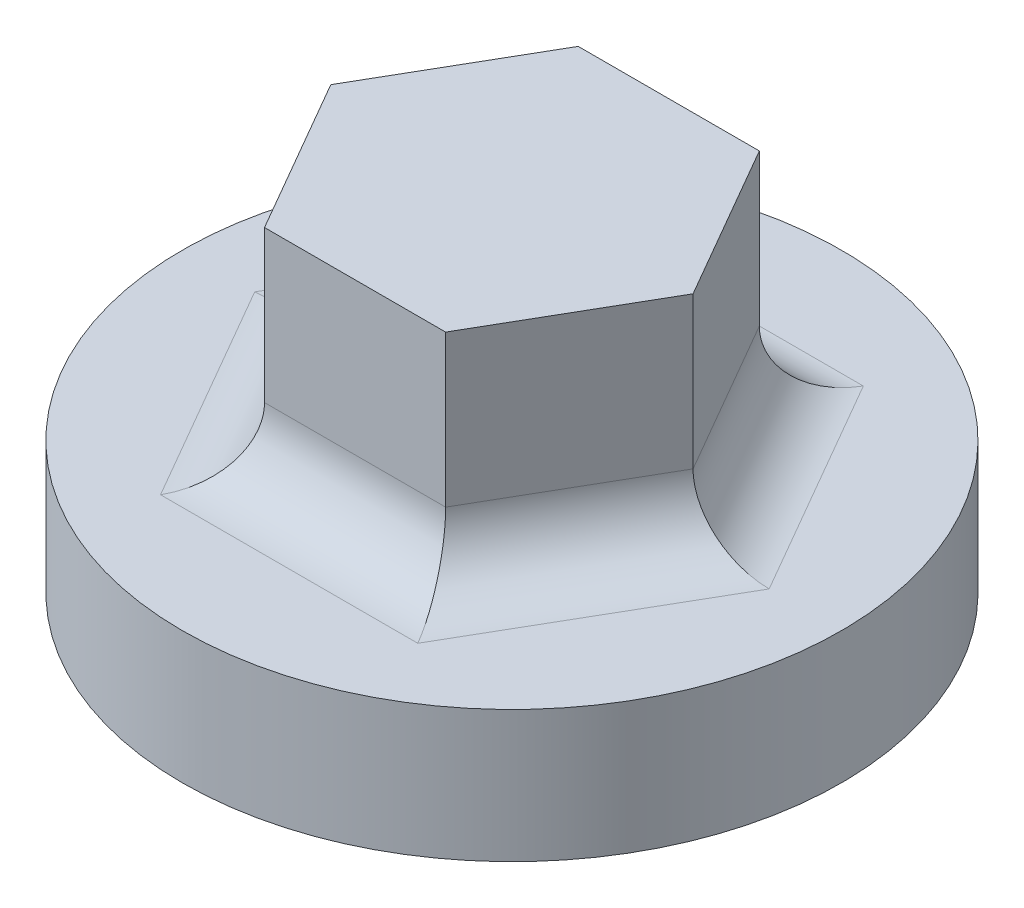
ISO-10303-21;
HEADER;
FILE_DESCRIPTION(('STEP AP214'),'2;1');
FILE_NAME('part.step','',(''),(''),'','','');
FILE_SCHEMA(('AUTOMOTIVE_DESIGN { 1 0 10303 214 1 1 1 1 }'));
ENDSEC;
DATA;
#1=APPLICATION_CONTEXT('core data for automotive mechanical design processes');
#2=APPLICATION_PROTOCOL_DEFINITION('international standard','automotive_design',2000,#1);
#3=PRODUCT_CONTEXT('',#1,'mechanical');
#4=PRODUCT('Part','Part','',(#3));
#5=PRODUCT_RELATED_PRODUCT_CATEGORY('part','',(#4));
#6=PRODUCT_DEFINITION_FORMATION('','',#4);
#7=PRODUCT_DEFINITION_CONTEXT('part definition',#1,'design');
#8=PRODUCT_DEFINITION('design','',#6,#7);
#9=PRODUCT_DEFINITION_SHAPE('','',#8);
#10=(LENGTH_UNIT() NAMED_UNIT(*) SI_UNIT(.MILLI.,.METRE.));
#11=(NAMED_UNIT(*) PLANE_ANGLE_UNIT() SI_UNIT($,.RADIAN.));
#12=(NAMED_UNIT(*) SI_UNIT($,.STERADIAN.) SOLID_ANGLE_UNIT());
#13=UNCERTAINTY_MEASURE_WITH_UNIT(LENGTH_MEASURE(1.E-05),#10,'distance_accuracy_value','');
#14=(GEOMETRIC_REPRESENTATION_CONTEXT(3) GLOBAL_UNCERTAINTY_ASSIGNED_CONTEXT((#13)) GLOBAL_UNIT_ASSIGNED_CONTEXT((#10,
#11,#12)) REPRESENTATION_CONTEXT('',''));
#15=CARTESIAN_POINT('',(0.,0.,0.));
#16=DIRECTION('',(0.,0.,1.));
#17=DIRECTION('',(1.,0.,0.));
#18=AXIS2_PLACEMENT_3D('',#15,#16,#17);
#19=CARTESIAN_POINT('',(0.,20.,0.));
#20=DIRECTION('',(0.,1.,0.));
#21=DIRECTION('',(0.,0.,1.));
#22=AXIS2_PLACEMENT_3D('',#19,#20,#21);
#23=PLANE('',#22);
#24=DIRECTION('',(1.,0.,0.));
#25=VECTOR('',#24,1.);
#26=CARTESIAN_POINT('',(0.,20.,33.7979229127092));
#27=LINE('',#26,#25);
#28=CARTESIAN_POINT('',(19.5132398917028,20.,33.7979229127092));
#29=VERTEX_POINT('',#28);
#30=CARTESIAN_POINT('',(-19.5132398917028,20.,33.7979229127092));
#31=VERTEX_POINT('',#30);
#32=EDGE_CURVE('E138',#29,#31,#27,.F.);
#33=ORIENTED_EDGE('',*,*,#32,.T.);
#34=DIRECTION('',(0.5,0.,0.866025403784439));
#35=VECTOR('',#34,1.);
#36=CARTESIAN_POINT('',(-29.2698598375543,20.,16.8989614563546));
#37=LINE('',#36,#35);
#38=CARTESIAN_POINT('',(-39.0264797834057,20.,0.));
#39=VERTEX_POINT('',#38);
#40=EDGE_CURVE('E146',#31,#39,#37,.F.);
#41=ORIENTED_EDGE('',*,*,#40,.T.);
#42=DIRECTION('',(-0.5,0.,0.866025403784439));
#43=VECTOR('',#42,1.);
#44=CARTESIAN_POINT('',(-29.2698598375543,20.,-16.8989614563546));
#45=LINE('',#44,#43);
#46=CARTESIAN_POINT('',(-19.5132398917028,20.,-33.7979229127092));
#47=VERTEX_POINT('',#46);
#48=EDGE_CURVE('E144',#39,#47,#45,.F.);
#49=ORIENTED_EDGE('',*,*,#48,.T.);
#50=DIRECTION('',(-1.,0.,0.));
#51=VECTOR('',#50,1.);
#52=CARTESIAN_POINT('',(0.,20.,-33.7979229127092));
#53=LINE('',#52,#51);
#54=CARTESIAN_POINT('',(19.5132398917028,20.,-33.7979229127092));
#55=VERTEX_POINT('',#54);
#56=EDGE_CURVE('E142',#47,#55,#53,.F.);
#57=ORIENTED_EDGE('',*,*,#56,.T.);
#58=DIRECTION('',(-0.5,0.,-0.866025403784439));
#59=VECTOR('',#58,1.);
#60=CARTESIAN_POINT('',(29.2698598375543,20.,-16.8989614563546));
#61=LINE('',#60,#59);
#62=CARTESIAN_POINT('',(39.0264797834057,20.,0.));
#63=VERTEX_POINT('',#62);
#64=EDGE_CURVE('E140',#55,#63,#61,.F.);
#65=ORIENTED_EDGE('',*,*,#64,.T.);
#66=DIRECTION('',(0.5,0.,-0.866025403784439));
#67=VECTOR('',#66,1.);
#68=CARTESIAN_POINT('',(29.2698598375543,20.,16.8989614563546));
#69=LINE('',#68,#67);
#70=EDGE_CURVE('E136',#63,#29,#69,.F.);
#71=ORIENTED_EDGE('',*,*,#70,.T.);
#72=EDGE_LOOP('',(#33,#41,#49,#57,#65,#71));
#73=FACE_BOUND('',#72,.T.);
#74=CARTESIAN_POINT('',(0.,20.,0.));
#75=DIRECTION('',(0.,1.,0.));
#76=DIRECTION('',(0.,0.,1.));
#77=AXIS2_PLACEMENT_3D('',#74,#75,#76);
#78=CIRCLE('',#77,50.);
#79=CARTESIAN_POINT('',(0.,20.,50.));
#80=VERTEX_POINT('',#79);
#81=EDGE_CURVE('E126',#80,#80,#78,.T.);
#82=ORIENTED_EDGE('',*,*,#81,.T.);
#83=EDGE_LOOP('',(#82));
#84=FACE_BOUND('',#83,.T.);
#85=ADVANCED_FACE('F27',(#73,#84),#23,.T.);
#86=CARTESIAN_POINT('',(0.,20.,0.));
#87=DIRECTION('',(0.,-1.,0.));
#88=DIRECTION('',(0.,0.,-1.));
#89=AXIS2_PLACEMENT_3D('',#86,#87,#88);
#90=CYLINDRICAL_SURFACE('',#89,50.);
#91=ORIENTED_EDGE('',*,*,#81,.F.);
#92=EDGE_LOOP('',(#91));
#93=FACE_BOUND('',#92,.T.);
#94=CARTESIAN_POINT('',(0.,0.,0.));
#95=DIRECTION('',(0.,1.,0.));
#96=DIRECTION('',(0.,0.,1.));
#97=AXIS2_PLACEMENT_3D('',#94,#95,#96);
#98=CIRCLE('',#97,50.);
#99=CARTESIAN_POINT('',(0.,0.,50.));
#100=VERTEX_POINT('',#99);
#101=EDGE_CURVE('E123',#100,#100,#98,.T.);
#102=ORIENTED_EDGE('',*,*,#101,.T.);
#103=EDGE_LOOP('',(#102));
#104=FACE_BOUND('',#103,.T.);
#105=ADVANCED_FACE('F29',(#93,#104),#90,.T.);
#106=CARTESIAN_POINT('',(0.,0.,0.));
#107=DIRECTION('',(0.,1.,0.));
#108=DIRECTION('',(0.,0.,1.));
#109=AXIS2_PLACEMENT_3D('',#106,#107,#108);
#110=PLANE('',#109);
#111=ORIENTED_EDGE('',*,*,#101,.F.);
#112=EDGE_LOOP('',(#111));
#113=FACE_BOUND('',#112,.T.);
#114=ADVANCED_FACE('F223',(#113),#110,.F.);
#115=CARTESIAN_POINT('',(-13.7397371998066,53.,-23.7979229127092));
#116=DIRECTION('',(0.866025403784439,0.,0.5));
#117=DIRECTION('',(0.5,0.,-0.866025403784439));
#118=AXIS2_PLACEMENT_3D('',#115,#116,#117);
#119=PLANE('',#118);
#120=DIRECTION('',(0.,-1.,0.));
#121=VECTOR('',#120,1.);
#122=CARTESIAN_POINT('',(-13.7397371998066,53.,-23.7979229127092));
#123=LINE('',#122,#121);
#124=CARTESIAN_POINT('',(-13.7397371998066,53.,-23.7979229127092));
#125=VERTEX_POINT('',#124);
#126=CARTESIAN_POINT('',(-13.7397371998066,30.,-23.7979229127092));
#127=VERTEX_POINT('',#126);
#128=EDGE_CURVE('E168',#125,#127,#123,.T.);
#129=ORIENTED_EDGE('',*,*,#128,.T.);
#130=DIRECTION('',(-0.5,0.,0.866025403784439));
#131=VECTOR('',#130,1.);
#132=CARTESIAN_POINT('',(-13.7397371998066,30.,-23.7979229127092));
#133=LINE('',#132,#131);
#134=CARTESIAN_POINT('',(-27.4794743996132,30.,0.));
#135=VERTEX_POINT('',#134);
#136=EDGE_CURVE('E122',#127,#135,#133,.T.);
#137=ORIENTED_EDGE('',*,*,#136,.T.);
#138=DIRECTION('',(0.,-1.,0.));
#139=VECTOR('',#138,1.);
#140=CARTESIAN_POINT('',(-27.4794743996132,53.,0.));
#141=LINE('',#140,#139);
#142=CARTESIAN_POINT('',(-27.4794743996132,53.,0.));
#143=VERTEX_POINT('',#142);
#144=EDGE_CURVE('E103',#143,#135,#141,.T.);
#145=ORIENTED_EDGE('',*,*,#144,.F.);
#146=DIRECTION('',(-0.5,0.,0.866025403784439));
#147=VECTOR('',#146,1.);
#148=CARTESIAN_POINT('',(-13.7397371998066,53.,-23.7979229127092));
#149=LINE('',#148,#147);
#150=EDGE_CURVE('E109',#125,#143,#149,.T.);
#151=ORIENTED_EDGE('',*,*,#150,.F.);
#152=EDGE_LOOP('',(#129,#137,#145,#151));
#153=FACE_BOUND('',#152,.T.);
#154=ADVANCED_FACE('F120',(#153),#119,.F.);
#155=CARTESIAN_POINT('',(-27.4794743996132,53.,0.));
#156=DIRECTION('',(0.866025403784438,0.,-0.5));
#157=DIRECTION('',(-0.5,0.,-0.866025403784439));
#158=AXIS2_PLACEMENT_3D('',#155,#156,#157);
#159=PLANE('',#158);
#160=ORIENTED_EDGE('',*,*,#144,.T.);
#161=DIRECTION('',(0.5,0.,0.866025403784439));
#162=VECTOR('',#161,1.);
#163=CARTESIAN_POINT('',(-27.4794743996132,30.,0.));
#164=LINE('',#163,#162);
#165=CARTESIAN_POINT('',(-13.7397371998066,30.,23.7979229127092));
#166=VERTEX_POINT('',#165);
#167=EDGE_CURVE('E134',#135,#166,#164,.T.);
#168=ORIENTED_EDGE('',*,*,#167,.T.);
#169=DIRECTION('',(0.,-1.,0.));
#170=VECTOR('',#169,1.);
#171=CARTESIAN_POINT('',(-13.7397371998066,53.,23.7979229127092));
#172=LINE('',#171,#170);
#173=CARTESIAN_POINT('',(-13.7397371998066,53.,23.7979229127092));
#174=VERTEX_POINT('',#173);
#175=EDGE_CURVE('E105',#174,#166,#172,.T.);
#176=ORIENTED_EDGE('',*,*,#175,.F.);
#177=DIRECTION('',(0.5,0.,0.866025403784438));
#178=VECTOR('',#177,1.);
#179=CARTESIAN_POINT('',(-27.4794743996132,53.,0.));
#180=LINE('',#179,#178);
#181=EDGE_CURVE('E98',#143,#174,#180,.T.);
#182=ORIENTED_EDGE('',*,*,#181,.F.);
#183=EDGE_LOOP('',(#160,#168,#176,#182));
#184=FACE_BOUND('',#183,.T.);
#185=ADVANCED_FACE('F100',(#184),#159,.F.);
#186=CARTESIAN_POINT('',(-13.7397371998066,53.,23.7979229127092));
#187=DIRECTION('',(0.,0.,-1.));
#188=DIRECTION('',(-1.,0.,0.));
#189=AXIS2_PLACEMENT_3D('',#186,#187,#188);
#190=PLANE('',#189);
#191=ORIENTED_EDGE('',*,*,#175,.T.);
#192=DIRECTION('',(1.,0.,0.));
#193=VECTOR('',#192,1.);
#194=CARTESIAN_POINT('',(-13.7397371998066,30.,23.7979229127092));
#195=LINE('',#194,#193);
#196=CARTESIAN_POINT('',(13.7397371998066,30.,23.7979229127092));
#197=VERTEX_POINT('',#196);
#198=EDGE_CURVE('E35',#166,#197,#195,.T.);
#199=ORIENTED_EDGE('',*,*,#198,.T.);
#200=DIRECTION('',(0.,-1.,0.));
#201=VECTOR('',#200,1.);
#202=CARTESIAN_POINT('',(13.7397371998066,53.,23.7979229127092));
#203=LINE('',#202,#201);
#204=CARTESIAN_POINT('',(13.7397371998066,53.,23.7979229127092));
#205=VERTEX_POINT('',#204);
#206=EDGE_CURVE('E128',#205,#197,#203,.T.);
#207=ORIENTED_EDGE('',*,*,#206,.F.);
#208=DIRECTION('',(1.,0.,0.));
#209=VECTOR('',#208,1.);
#210=CARTESIAN_POINT('',(-13.7397371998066,53.,23.7979229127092));
#211=LINE('',#210,#209);
#212=EDGE_CURVE('E108',#174,#205,#211,.T.);
#213=ORIENTED_EDGE('',*,*,#212,.F.);
#214=EDGE_LOOP('',(#191,#199,#207,#213));
#215=FACE_BOUND('',#214,.T.);
#216=ADVANCED_FACE('F194',(#215),#190,.F.);
#217=CARTESIAN_POINT('',(13.7397371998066,53.,23.7979229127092));
#218=DIRECTION('',(-0.866025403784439,0.,-0.5));
#219=DIRECTION('',(-0.5,0.,0.866025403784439));
#220=AXIS2_PLACEMENT_3D('',#217,#218,#219);
#221=PLANE('',#220);
#222=ORIENTED_EDGE('',*,*,#206,.T.);
#223=DIRECTION('',(0.5,0.,-0.866025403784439));
#224=VECTOR('',#223,1.);
#225=CARTESIAN_POINT('',(13.7397371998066,30.,23.7979229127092));
#226=LINE('',#225,#224);
#227=CARTESIAN_POINT('',(27.4794743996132,30.,0.));
#228=VERTEX_POINT('',#227);
#229=EDGE_CURVE('E11',#197,#228,#226,.T.);
#230=ORIENTED_EDGE('',*,*,#229,.T.);
#231=DIRECTION('',(0.,-1.,0.));
#232=VECTOR('',#231,1.);
#233=CARTESIAN_POINT('',(27.4794743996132,53.,0.));
#234=LINE('',#233,#232);
#235=CARTESIAN_POINT('',(27.4794743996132,53.,0.));
#236=VERTEX_POINT('',#235);
#237=EDGE_CURVE('E160',#236,#228,#234,.T.);
#238=ORIENTED_EDGE('',*,*,#237,.F.);
#239=DIRECTION('',(0.5,0.,-0.866025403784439));
#240=VECTOR('',#239,1.);
#241=CARTESIAN_POINT('',(13.7397371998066,53.,23.7979229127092));
#242=LINE('',#241,#240);
#243=EDGE_CURVE('E196',#205,#236,#242,.T.);
#244=ORIENTED_EDGE('',*,*,#243,.F.);
#245=EDGE_LOOP('',(#222,#230,#238,#244));
#246=FACE_BOUND('',#245,.T.);
#247=ADVANCED_FACE('F204',(#246),#221,.F.);
#248=CARTESIAN_POINT('',(27.4794743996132,53.,0.));
#249=DIRECTION('',(-0.866025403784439,0.,0.5));
#250=DIRECTION('',(0.5,0.,0.866025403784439));
#251=AXIS2_PLACEMENT_3D('',#248,#249,#250);
#252=PLANE('',#251);
#253=ORIENTED_EDGE('',*,*,#237,.T.);
#254=DIRECTION('',(-0.5,0.,-0.866025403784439));
#255=VECTOR('',#254,1.);
#256=CARTESIAN_POINT('',(27.4794743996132,30.,0.));
#257=LINE('',#256,#255);
#258=CARTESIAN_POINT('',(13.7397371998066,30.,-23.7979229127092));
#259=VERTEX_POINT('',#258);
#260=EDGE_CURVE('E152',#228,#259,#257,.T.);
#261=ORIENTED_EDGE('',*,*,#260,.T.);
#262=DIRECTION('',(0.,-1.,0.));
#263=VECTOR('',#262,1.);
#264=CARTESIAN_POINT('',(13.7397371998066,53.,-23.7979229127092));
#265=LINE('',#264,#263);
#266=CARTESIAN_POINT('',(13.7397371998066,53.,-23.7979229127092));
#267=VERTEX_POINT('',#266);
#268=EDGE_CURVE('E159',#267,#259,#265,.T.);
#269=ORIENTED_EDGE('',*,*,#268,.F.);
#270=DIRECTION('',(-0.5,0.,-0.866025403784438));
#271=VECTOR('',#270,1.);
#272=CARTESIAN_POINT('',(27.4794743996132,53.,0.));
#273=LINE('',#272,#271);
#274=EDGE_CURVE('E198',#236,#267,#273,.T.);
#275=ORIENTED_EDGE('',*,*,#274,.F.);
#276=EDGE_LOOP('',(#253,#261,#269,#275));
#277=FACE_BOUND('',#276,.T.);
#278=ADVANCED_FACE('F157',(#277),#252,.F.);
#279=CARTESIAN_POINT('',(13.7397371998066,53.,-23.7979229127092));
#280=DIRECTION('',(0.,0.,1.));
#281=DIRECTION('',(1.,0.,0.));
#282=AXIS2_PLACEMENT_3D('',#279,#280,#281);
#283=PLANE('',#282);
#284=ORIENTED_EDGE('',*,*,#268,.T.);
#285=DIRECTION('',(-1.,0.,0.));
#286=VECTOR('',#285,1.);
#287=CARTESIAN_POINT('',(13.7397371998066,30.,-23.7979229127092));
#288=LINE('',#287,#286);
#289=EDGE_CURVE('E150',#259,#127,#288,.T.);
#290=ORIENTED_EDGE('',*,*,#289,.T.);
#291=ORIENTED_EDGE('',*,*,#128,.F.);
#292=DIRECTION('',(-1.,0.,0.));
#293=VECTOR('',#292,1.);
#294=CARTESIAN_POINT('',(13.7397371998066,53.,-23.7979229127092));
#295=LINE('',#294,#293);
#296=EDGE_CURVE('E114',#267,#125,#295,.T.);
#297=ORIENTED_EDGE('',*,*,#296,.F.);
#298=EDGE_LOOP('',(#284,#290,#291,#297));
#299=FACE_BOUND('',#298,.T.);
#300=ADVANCED_FACE('F166',(#299),#283,.F.);
#301=CARTESIAN_POINT('',(-13.7397371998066,53.,-23.7979229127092));
#302=DIRECTION('',(0.,-1.,0.));
#303=DIRECTION('',(0.,0.,-1.));
#304=AXIS2_PLACEMENT_3D('',#301,#302,#303);
#305=PLANE('',#304);
#306=ORIENTED_EDGE('',*,*,#150,.T.);
#307=ORIENTED_EDGE('',*,*,#181,.T.);
#308=ORIENTED_EDGE('',*,*,#212,.T.);
#309=ORIENTED_EDGE('',*,*,#243,.T.);
#310=ORIENTED_EDGE('',*,*,#274,.T.);
#311=ORIENTED_EDGE('',*,*,#296,.T.);
#312=EDGE_LOOP('',(#306,#307,#308,#309,#310,#311));
#313=FACE_BOUND('',#312,.T.);
#314=ADVANCED_FACE('F112',(#313),#305,.F.);
#315=CARTESIAN_POINT('',(36.1397284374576,30.,-5.));
#316=DIRECTION('',(-0.5,0.,-0.866025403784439));
#317=DIRECTION('',(-0.866025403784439,0.,0.5));
#318=AXIS2_PLACEMENT_3D('',#315,#316,#317);
#319=CYLINDRICAL_SURFACE('',#318,10.);
#320=CARTESIAN_POINT('',(39.0264797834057,30.,0.));
#321=DIRECTION('',(0.,0.,-1.));
#322=DIRECTION('',(1.,0.,0.));
#323=AXIS2_PLACEMENT_3D('',#320,#321,#322);
#324=ELLIPSE('',#323,11.5470053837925,10.);
#325=EDGE_CURVE('E175',#63,#228,#324,.T.);
#326=ORIENTED_EDGE('',*,*,#325,.F.);
#327=ORIENTED_EDGE('',*,*,#64,.F.);
#328=CARTESIAN_POINT('',(19.5132398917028,30.,-33.7979229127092));
#329=DIRECTION('',(-0.866025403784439,0.,-0.5));
#330=DIRECTION('',(0.5,0.,-0.866025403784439));
#331=AXIS2_PLACEMENT_3D('',#328,#329,#330);
#332=ELLIPSE('',#331,11.5470053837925,10.);
#333=EDGE_CURVE('E118',#259,#55,#332,.F.);
#334=ORIENTED_EDGE('',*,*,#333,.F.);
#335=ORIENTED_EDGE('',*,*,#260,.F.);
#336=EDGE_LOOP('',(#326,#327,#334,#335));
#337=FACE_BOUND('',#336,.T.);
#338=ADVANCED_FACE('F172',(#337),#319,.F.);
#339=CARTESIAN_POINT('',(13.7397371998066,30.,-33.7979229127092));
#340=DIRECTION('',(-1.,0.,0.));
#341=DIRECTION('',(0.,0.,1.));
#342=AXIS2_PLACEMENT_3D('',#339,#340,#341);
#343=CYLINDRICAL_SURFACE('',#342,10.);
#344=ORIENTED_EDGE('',*,*,#333,.T.);
#345=ORIENTED_EDGE('',*,*,#56,.F.);
#346=CARTESIAN_POINT('',(-19.5132398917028,30.,-33.7979229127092));
#347=DIRECTION('',(-0.866025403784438,0.,0.5));
#348=DIRECTION('',(-0.5,0.,-0.866025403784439));
#349=AXIS2_PLACEMENT_3D('',#346,#347,#348);
#350=ELLIPSE('',#349,11.5470053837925,10.);
#351=EDGE_CURVE('E180',#127,#47,#350,.F.);
#352=ORIENTED_EDGE('',*,*,#351,.F.);
#353=ORIENTED_EDGE('',*,*,#289,.F.);
#354=EDGE_LOOP('',(#344,#345,#352,#353));
#355=FACE_BOUND('',#354,.T.);
#356=ADVANCED_FACE('F178',(#355),#343,.F.);
#357=CARTESIAN_POINT('',(22.399991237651,30.,28.7979229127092));
#358=DIRECTION('',(0.5,0.,-0.866025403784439));
#359=DIRECTION('',(-0.866025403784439,0.,-0.5));
#360=AXIS2_PLACEMENT_3D('',#357,#358,#359);
#361=CYLINDRICAL_SURFACE('',#360,10.);
#362=ORIENTED_EDGE('',*,*,#325,.T.);
#363=ORIENTED_EDGE('',*,*,#229,.F.);
#364=CARTESIAN_POINT('',(19.5132398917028,30.,33.7979229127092));
#365=DIRECTION('',(0.866025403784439,0.,-0.5));
#366=DIRECTION('',(-0.5,0.,-0.866025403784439));
#367=AXIS2_PLACEMENT_3D('',#364,#365,#366);
#368=ELLIPSE('',#367,11.5470053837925,10.);
#369=EDGE_CURVE('E183',#29,#197,#368,.T.);
#370=ORIENTED_EDGE('',*,*,#369,.F.);
#371=ORIENTED_EDGE('',*,*,#70,.F.);
#372=EDGE_LOOP('',(#362,#363,#370,#371));
#373=FACE_BOUND('',#372,.T.);
#374=ADVANCED_FACE('F208',(#373),#361,.F.);
#375=CARTESIAN_POINT('',(-22.399991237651,30.,-28.7979229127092));
#376=DIRECTION('',(-0.5,0.,0.866025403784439));
#377=DIRECTION('',(0.866025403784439,0.,0.5));
#378=AXIS2_PLACEMENT_3D('',#375,#376,#377);
#379=CYLINDRICAL_SURFACE('',#378,10.);
#380=ORIENTED_EDGE('',*,*,#351,.T.);
#381=ORIENTED_EDGE('',*,*,#48,.F.);
#382=CARTESIAN_POINT('',(-39.0264797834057,30.,0.));
#383=DIRECTION('',(0.,0.,1.));
#384=DIRECTION('',(-1.,0.,0.));
#385=AXIS2_PLACEMENT_3D('',#382,#383,#384);
#386=ELLIPSE('',#385,11.5470053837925,10.);
#387=EDGE_CURVE('E186',#135,#39,#386,.F.);
#388=ORIENTED_EDGE('',*,*,#387,.F.);
#389=ORIENTED_EDGE('',*,*,#136,.F.);
#390=EDGE_LOOP('',(#380,#381,#388,#389));
#391=FACE_BOUND('',#390,.T.);
#392=ADVANCED_FACE('F185',(#391),#379,.F.);
#393=CARTESIAN_POINT('',(-13.7397371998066,30.,33.7979229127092));
#394=DIRECTION('',(1.,0.,0.));
#395=DIRECTION('',(0.,0.,-1.));
#396=AXIS2_PLACEMENT_3D('',#393,#394,#395);
#397=CYLINDRICAL_SURFACE('',#396,10.);
#398=ORIENTED_EDGE('',*,*,#369,.T.);
#399=ORIENTED_EDGE('',*,*,#198,.F.);
#400=CARTESIAN_POINT('',(-19.5132398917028,30.,33.7979229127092));
#401=DIRECTION('',(0.866025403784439,0.,0.5));
#402=DIRECTION('',(0.5,0.,-0.866025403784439));
#403=AXIS2_PLACEMENT_3D('',#400,#401,#402);
#404=ELLIPSE('',#403,11.5470053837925,10.);
#405=EDGE_CURVE('E190',#31,#166,#404,.T.);
#406=ORIENTED_EDGE('',*,*,#405,.F.);
#407=ORIENTED_EDGE('',*,*,#32,.F.);
#408=EDGE_LOOP('',(#398,#399,#406,#407));
#409=FACE_BOUND('',#408,.T.);
#410=ADVANCED_FACE('F212',(#409),#397,.F.);
#411=CARTESIAN_POINT('',(-36.1397284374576,30.,5.00000000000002));
#412=DIRECTION('',(0.5,0.,0.866025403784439));
#413=DIRECTION('',(0.866025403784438,0.,-0.5));
#414=AXIS2_PLACEMENT_3D('',#411,#412,#413);
#415=CYLINDRICAL_SURFACE('',#414,10.);
#416=ORIENTED_EDGE('',*,*,#387,.T.);
#417=ORIENTED_EDGE('',*,*,#40,.F.);
#418=ORIENTED_EDGE('',*,*,#405,.T.);
#419=ORIENTED_EDGE('',*,*,#167,.F.);
#420=EDGE_LOOP('',(#416,#417,#418,#419));
#421=FACE_BOUND('',#420,.T.);
#422=ADVANCED_FACE('F192',(#421),#415,.F.);
#423=CLOSED_SHELL('',(#85,#105,#114,#154,#185,#216,#247,#278,#300,#314,#338,#356,#374,#392,#410,#422));
#424=MANIFOLD_SOLID_BREP('B2',#423);
#425=ADVANCED_BREP_SHAPE_REPRESENTATION('',(#18,#424),#14);
#426=SHAPE_DEFINITION_REPRESENTATION(#9,#425);
ENDSEC;
END-ISO-10303-21;
